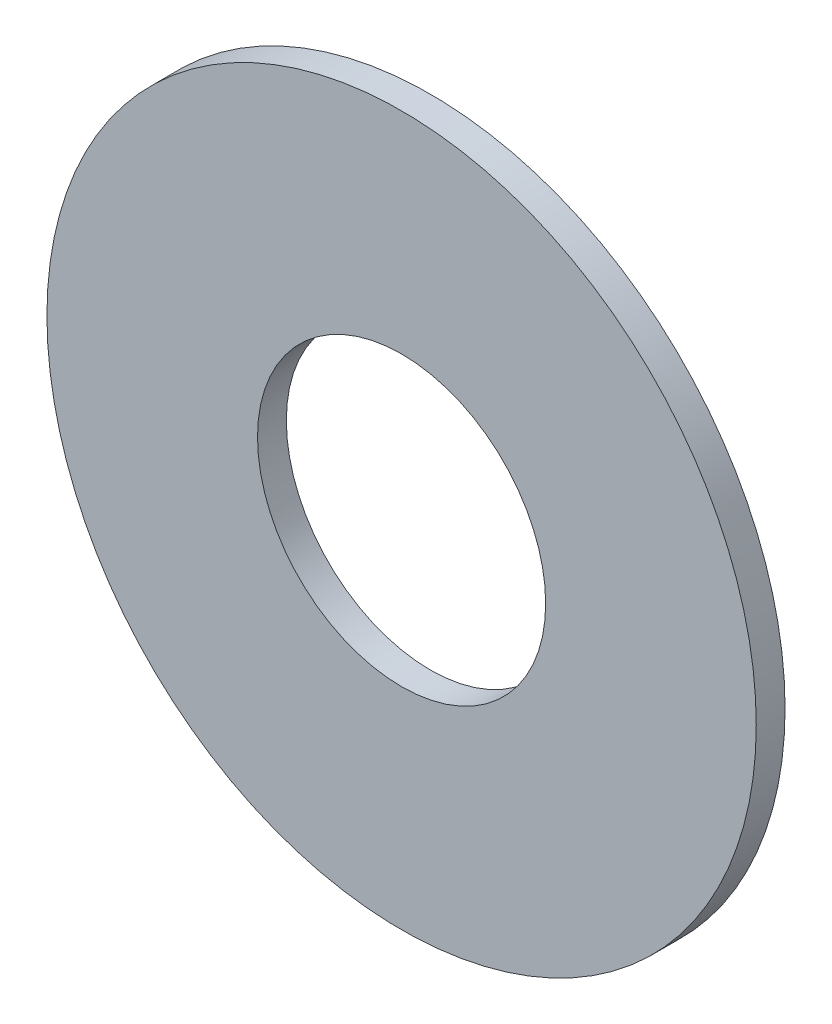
from build123d import *

# Parameters (mm, degrees)
ESQUISSE1_R      = 16
ESQUISSE1_R_2    = 6.5
EXTRUSION1_DEPTH = 1.3


with BuildPart() as part:
    # Esquisse1 → Extrusion1 (new body)
    with BuildSketch(Plane.XY):
        Circle(ESQUISSE1_R)
        Circle(ESQUISSE1_R_2, mode=Mode.SUBTRACT)
    extrude(amount=EXTRUSION1_DEPTH)


solid = part.part
